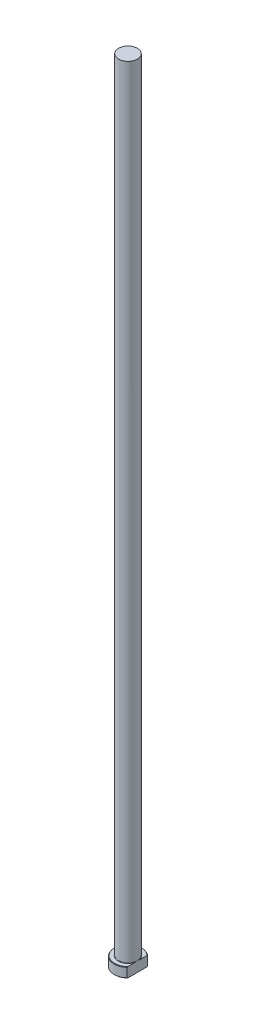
ISO-10303-21;
HEADER;
FILE_DESCRIPTION(('STEP AP214'),'2;1');
FILE_NAME('part.step','',(''),(''),'','','');
FILE_SCHEMA(('AUTOMOTIVE_DESIGN { 1 0 10303 214 1 1 1 1 }'));
ENDSEC;
DATA;
#1=APPLICATION_CONTEXT('core data for automotive mechanical design processes');
#2=APPLICATION_PROTOCOL_DEFINITION('international standard','automotive_design',2000,#1);
#3=PRODUCT_CONTEXT('',#1,'mechanical');
#4=PRODUCT('Part','Part','',(#3));
#5=PRODUCT_RELATED_PRODUCT_CATEGORY('part','',(#4));
#6=PRODUCT_DEFINITION_FORMATION('','',#4);
#7=PRODUCT_DEFINITION_CONTEXT('part definition',#1,'design');
#8=PRODUCT_DEFINITION('design','',#6,#7);
#9=PRODUCT_DEFINITION_SHAPE('','',#8);
#10=(LENGTH_UNIT() NAMED_UNIT(*) SI_UNIT(.MILLI.,.METRE.));
#11=(NAMED_UNIT(*) PLANE_ANGLE_UNIT() SI_UNIT($,.RADIAN.));
#12=(NAMED_UNIT(*) SI_UNIT($,.STERADIAN.) SOLID_ANGLE_UNIT());
#13=UNCERTAINTY_MEASURE_WITH_UNIT(LENGTH_MEASURE(1.E-05),#10,'distance_accuracy_value','');
#14=(GEOMETRIC_REPRESENTATION_CONTEXT(3) GLOBAL_UNCERTAINTY_ASSIGNED_CONTEXT((#13)) GLOBAL_UNIT_ASSIGNED_CONTEXT((#10,
#11,#12)) REPRESENTATION_CONTEXT('',''));
#15=CARTESIAN_POINT('',(0.,0.,0.));
#16=DIRECTION('',(0.,0.,1.));
#17=DIRECTION('',(1.,0.,0.));
#18=AXIS2_PLACEMENT_3D('',#15,#16,#17);
#19=CARTESIAN_POINT('',(0.,0.,0.));
#20=DIRECTION('',(0.,-1.,0.));
#21=DIRECTION('',(0.,0.,-1.));
#22=AXIS2_PLACEMENT_3D('',#19,#20,#21);
#23=PLANE('',#22);
#24=CARTESIAN_POINT('',(0.,0.,0.));
#25=DIRECTION('',(0.,-1.,0.));
#26=DIRECTION('',(0.,0.,-1.));
#27=AXIS2_PLACEMENT_3D('',#24,#25,#26);
#28=CIRCLE('',#27,6.79999999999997);
#29=CARTESIAN_POINT('',(4.74999999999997,0.,4.86595314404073));
#30=VERTEX_POINT('',#29);
#31=CARTESIAN_POINT('',(4.74999999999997,0.,-4.86595314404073));
#32=VERTEX_POINT('',#31);
#33=EDGE_CURVE('E98',#30,#32,#28,.T.);
#34=ORIENTED_EDGE('',*,*,#33,.T.);
#35=DIRECTION('',(0.,0.,1.));
#36=VECTOR('',#35,1.);
#37=CARTESIAN_POINT('',(4.74999999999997,0.,-5.14174095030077));
#38=LINE('',#37,#36);
#39=EDGE_CURVE('E83',#32,#30,#38,.T.);
#40=ORIENTED_EDGE('',*,*,#39,.T.);
#41=EDGE_LOOP('',(#34,#40));
#42=FACE_BOUND('',#41,.T.);
#43=ADVANCED_FACE('F32',(#42),#23,.T.);
#44=CARTESIAN_POINT('',(0.,259.958771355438,0.));
#45=DIRECTION('',(0.,1.,0.));
#46=DIRECTION('',(0.,0.,1.));
#47=AXIS2_PLACEMENT_3D('',#44,#45,#46);
#48=CYLINDRICAL_SURFACE('',#47,6.99999999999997);
#49=CARTESIAN_POINT('',(0.,4.80000000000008,0.));
#50=DIRECTION('',(0.,1.,0.));
#51=DIRECTION('',(0.,0.,1.));
#52=AXIS2_PLACEMENT_3D('',#49,#50,#51);
#53=CIRCLE('',#52,6.99999999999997);
#54=CARTESIAN_POINT('',(4.74999999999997,4.80000000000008,5.14174095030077));
#55=VERTEX_POINT('',#54);
#56=CARTESIAN_POINT('',(4.74999999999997,4.80000000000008,-5.14174095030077));
#57=VERTEX_POINT('',#56);
#58=EDGE_CURVE('E104',#55,#57,#53,.F.);
#59=ORIENTED_EDGE('',*,*,#58,.T.);
#60=DIRECTION('',(0.,-1.,0.));
#61=VECTOR('',#60,1.);
#62=CARTESIAN_POINT('',(4.74999999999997,400.,-5.14174095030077));
#63=LINE('',#62,#61);
#64=CARTESIAN_POINT('',(4.74999999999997,0.199999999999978,-5.14174095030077));
#65=VERTEX_POINT('',#64);
#66=EDGE_CURVE('E183',#57,#65,#63,.T.);
#67=ORIENTED_EDGE('',*,*,#66,.T.);
#68=CARTESIAN_POINT('',(0.,0.199999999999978,0.));
#69=DIRECTION('',(0.,-1.,0.));
#70=DIRECTION('',(0.,0.,-1.));
#71=AXIS2_PLACEMENT_3D('',#68,#69,#70);
#72=CIRCLE('',#71,6.99999999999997);
#73=CARTESIAN_POINT('',(4.74999999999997,0.199999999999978,5.14174095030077));
#74=VERTEX_POINT('',#73);
#75=EDGE_CURVE('E100',#65,#74,#72,.F.);
#76=ORIENTED_EDGE('',*,*,#75,.T.);
#77=DIRECTION('',(0.,-1.,0.));
#78=VECTOR('',#77,1.);
#79=CARTESIAN_POINT('',(4.74999999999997,400.,5.14174095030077));
#80=LINE('',#79,#78);
#81=EDGE_CURVE('E93',#55,#74,#80,.T.);
#82=ORIENTED_EDGE('',*,*,#81,.F.);
#83=EDGE_LOOP('',(#59,#67,#76,#82));
#84=FACE_BOUND('',#83,.T.);
#85=ADVANCED_FACE('F158',(#84),#48,.T.);
#86=CARTESIAN_POINT('',(-6.99999999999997,5.,0.));
#87=DIRECTION('',(0.,1.,0.));
#88=DIRECTION('',(0.,0.,1.));
#89=AXIS2_PLACEMENT_3D('',#86,#87,#88);
#90=PLANE('',#89);
#91=CARTESIAN_POINT('',(0.,5.,0.));
#92=DIRECTION('',(0.,1.,0.));
#93=DIRECTION('',(0.,0.,1.));
#94=AXIS2_PLACEMENT_3D('',#91,#92,#93);
#95=CIRCLE('',#94,6.80000000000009);
#96=CARTESIAN_POINT('',(4.74999999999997,5.,-4.8659531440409));
#97=VERTEX_POINT('',#96);
#98=CARTESIAN_POINT('',(4.74999999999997,5.,4.8659531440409));
#99=VERTEX_POINT('',#98);
#100=EDGE_CURVE('E178',#97,#99,#95,.T.);
#101=ORIENTED_EDGE('',*,*,#100,.T.);
#102=DIRECTION('',(0.,0.,-1.));
#103=VECTOR('',#102,1.);
#104=CARTESIAN_POINT('',(4.74999999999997,5.,0.));
#105=LINE('',#104,#103);
#106=CARTESIAN_POINT('',(4.74999999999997,4.99999999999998,1.3928388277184));
#107=VERTEX_POINT('',#106);
#108=EDGE_CURVE('E57',#99,#107,#105,.T.);
#109=ORIENTED_EDGE('',*,*,#108,.T.);
#110=CARTESIAN_POINT('',(0.,5.,0.));
#111=DIRECTION('',(0.,1.,0.));
#112=DIRECTION('',(0.,0.,1.));
#113=AXIS2_PLACEMENT_3D('',#110,#111,#112);
#114=CIRCLE('',#113,4.94999999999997);
#115=CARTESIAN_POINT('',(4.74999999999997,4.99999999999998,-1.3928388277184));
#116=VERTEX_POINT('',#115);
#117=EDGE_CURVE('E107',#107,#116,#114,.F.);
#118=ORIENTED_EDGE('',*,*,#117,.T.);
#119=EDGE_CURVE('E136',#116,#97,#105,.T.);
#120=ORIENTED_EDGE('',*,*,#119,.T.);
#121=EDGE_LOOP('',(#101,#109,#118,#120));
#122=FACE_BOUND('',#121,.T.);
#123=ADVANCED_FACE('F147',(#122),#90,.T.);
#124=CARTESIAN_POINT('',(0.,5.,0.));
#125=DIRECTION('',(0.,-1.,0.));
#126=DIRECTION('',(0.,0.,-1.));
#127=AXIS2_PLACEMENT_3D('',#124,#125,#126);
#128=CONICAL_SURFACE('',#127,6.80000000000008,0.785398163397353);
#129=ORIENTED_EDGE('',*,*,#58,.F.);
#130=CARTESIAN_POINT('',(4.74999999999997,-0.4699194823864,11.3131969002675));
#131=CARTESIAN_POINT('',(4.74999999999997,-0.314696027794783,11.1448436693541));
#132=CARTESIAN_POINT('',(4.74999999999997,-0.159749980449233,10.9762347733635));
#133=CARTESIAN_POINT('',(4.74999999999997,0.149503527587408,10.6384300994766));
#134=CARTESIAN_POINT('',(4.74999999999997,0.303810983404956,10.4692343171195));
#135=CARTESIAN_POINT('',(4.74999999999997,0.765713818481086,9.96058276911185));
#136=CARTESIAN_POINT('',(4.74999999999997,1.07222147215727,9.62013661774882));
#137=CARTESIAN_POINT('',(4.74999999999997,1.68320129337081,8.93374171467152));
#138=CARTESIAN_POINT('',(4.74999999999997,1.98765016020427,8.58777219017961));
#139=CARTESIAN_POINT('',(4.74999999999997,2.59113928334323,7.89119777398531));
#140=CARTESIAN_POINT('',(4.74999999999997,2.8901801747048,7.54059343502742));
#141=CARTESIAN_POINT('',(4.74999999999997,3.42455557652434,6.90003552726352));
#142=CARTESIAN_POINT('',(4.74999999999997,3.66121599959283,6.61119029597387));
#143=CARTESIAN_POINT('',(4.74999999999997,4.12759376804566,6.02778658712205));
#144=CARTESIAN_POINT('',(4.74999999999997,4.35730941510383,5.73322674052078));
#145=CARTESIAN_POINT('',(4.74999999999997,4.6941695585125,5.28581629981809));
#146=CARTESIAN_POINT('',(4.74999999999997,4.80511599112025,5.13582910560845));
#147=CARTESIAN_POINT('',(4.74999999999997,5.02390767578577,4.83361366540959));
#148=CARTESIAN_POINT('',(4.74999999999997,5.1317530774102,4.68138552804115));
#149=CARTESIAN_POINT('',(4.74999999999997,5.34359776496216,4.37435384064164));
#150=CARTESIAN_POINT('',(4.74999999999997,5.44759851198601,4.21955130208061));
#151=CARTESIAN_POINT('',(4.74999999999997,5.65085213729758,3.90687079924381));
#152=CARTESIAN_POINT('',(4.74999999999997,5.75010555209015,3.7489931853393));
#153=CARTESIAN_POINT('',(4.74999999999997,5.94167933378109,3.43122886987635));
#154=CARTESIAN_POINT('',(4.74999999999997,6.0340594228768,3.27137837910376));
#155=CARTESIAN_POINT('',(4.74999999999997,6.21141459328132,2.94756528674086));
#156=CARTESIAN_POINT('',(4.74999999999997,6.29638886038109,2.78360223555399));
#157=CARTESIAN_POINT('',(4.74999999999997,6.45680192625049,2.45121104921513));
#158=CARTESIAN_POINT('',(4.74999999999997,6.53224904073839,2.28278696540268));
#159=CARTESIAN_POINT('',(4.74999999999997,6.6710923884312,1.94101575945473));
#160=CARTESIAN_POINT('',(4.74999999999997,6.7344921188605,1.76767008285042));
#161=CARTESIAN_POINT('',(4.74999999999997,6.83411180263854,1.45416369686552));
#162=CARTESIAN_POINT('',(4.74999999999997,6.87324454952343,1.31493382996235));
#163=CARTESIAN_POINT('',(4.74999999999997,6.94070239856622,1.03386040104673));
#164=CARTESIAN_POINT('',(4.74999999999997,6.96902891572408,0.892017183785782));
#165=CARTESIAN_POINT('',(4.74999999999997,7.01345691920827,0.606842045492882));
#166=CARTESIAN_POINT('',(4.74999999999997,7.02959521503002,0.46351594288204));
#167=CARTESIAN_POINT('',(4.74999999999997,7.04890487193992,0.17598432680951));
#168=CARTESIAN_POINT('',(4.74999999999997,7.0520767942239,0.0317788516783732));
#169=CARTESIAN_POINT('',(4.74999999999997,7.04526462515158,-0.256545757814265));
#170=CARTESIAN_POINT('',(4.74999999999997,7.03525957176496,-0.400664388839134));
#171=CARTESIAN_POINT('',(4.74999999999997,7.00262759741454,-0.687454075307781));
#172=CARTESIAN_POINT('',(4.74999999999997,6.97999962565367,-0.830125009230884));
#173=CARTESIAN_POINT('',(4.74999999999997,6.92319898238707,-1.11357185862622));
#174=CARTESIAN_POINT('',(4.74999999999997,6.88899117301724,-1.25434063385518));
#175=CARTESIAN_POINT('',(4.74999999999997,6.81053576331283,-1.53301777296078));
#176=CARTESIAN_POINT('',(4.74999999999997,6.76628793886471,-1.6709260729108));
#177=CARTESIAN_POINT('',(4.74999999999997,6.66151350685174,-1.96556191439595));
#178=CARTESIAN_POINT('',(4.74999999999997,6.59951436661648,-2.12176199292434));
#179=CARTESIAN_POINT('',(4.74999999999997,6.46624368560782,-2.43018851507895));
#180=CARTESIAN_POINT('',(4.74999999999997,6.3949679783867,-2.58241313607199));
#181=CARTESIAN_POINT('',(4.74999999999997,6.24487152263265,-2.88340045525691));
#182=CARTESIAN_POINT('',(4.74999999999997,6.16603778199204,-3.03215662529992));
#183=CARTESIAN_POINT('',(4.74999999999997,6.0024213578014,-3.32631225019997));
#184=CARTESIAN_POINT('',(4.74999999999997,5.91763949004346,-3.47171216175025));
#185=CARTESIAN_POINT('',(4.74999999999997,5.7422196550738,-3.76133460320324));
#186=CARTESIAN_POINT('',(4.74999999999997,5.65152319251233,-3.90552153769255));
#187=CARTESIAN_POINT('',(4.74999999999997,5.46614513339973,-4.1913052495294));
#188=CARTESIAN_POINT('',(4.74999999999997,5.37146343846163,-4.33290196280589));
#189=CARTESIAN_POINT('',(4.74999999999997,5.1789439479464,-4.61371009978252));
#190=CARTESIAN_POINT('',(4.74999999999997,5.0811095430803,-4.75292385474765));
#191=CARTESIAN_POINT('',(4.74999999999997,4.88274984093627,-5.02942406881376));
#192=CARTESIAN_POINT('',(4.74999999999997,4.78222443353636,-5.1667104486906));
#193=CARTESIAN_POINT('',(4.74999999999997,4.47850577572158,-5.57446661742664));
#194=CARTESIAN_POINT('',(4.74999999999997,4.27202152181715,-5.84248508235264));
#195=CARTESIAN_POINT('',(4.74999999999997,3.85277361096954,-6.37356852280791));
#196=CARTESIAN_POINT('',(4.74999999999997,3.64000936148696,-6.63663302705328));
#197=CARTESIAN_POINT('',(4.74999999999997,3.20967704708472,-7.15912738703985));
#198=CARTESIAN_POINT('',(4.74999999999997,2.99210547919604,-7.41855435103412));
#199=CARTESIAN_POINT('',(4.74999999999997,2.55343543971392,-7.93440929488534));
#200=CARTESIAN_POINT('',(4.74999999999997,2.33233690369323,-8.19083721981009));
#201=CARTESIAN_POINT('',(4.74999999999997,1.8985117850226,-8.68856037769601));
#202=CARTESIAN_POINT('',(4.74999999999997,1.68591840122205,-8.92997190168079));
#203=CARTESIAN_POINT('',(4.74999999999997,1.25875024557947,-9.41103988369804));
#204=CARTESIAN_POINT('',(4.74999999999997,1.04417544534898,-9.65069631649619));
#205=CARTESIAN_POINT('',(4.74999999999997,0.613761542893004,-10.1281845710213));
#206=CARTESIAN_POINT('',(4.74999999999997,0.39792496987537,-10.3660186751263));
#207=CARTESIAN_POINT('',(4.74999999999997,-0.035070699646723,-10.8404648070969));
#208=CARTESIAN_POINT('',(4.74999999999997,-0.252229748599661,-11.0770768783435));
#209=CARTESIAN_POINT('',(4.74999999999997,-0.4699194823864,-11.3131969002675));
#210=B_SPLINE_CURVE_WITH_KNOTS('',3,(#130,#131,#132,#133,#134,#135,#136,#137,#138,#139,#140,
#141,#142,#143,#144,#145,#146,#147,#148,#149,#150,#151,#152,#153,#154,#155,#156,#157,#158,#159,
#160,#161,#162,#163,#164,#165,#166,#167,#168,#169,#170,#171,#172,#173,#174,#175,#176,#177,#178,
#179,#180,#181,#182,#183,#184,#185,#186,#187,#188,#189,#190,#191,#192,#193,#194,#195,#196,#197,
#198,#199,#200,#201,#202,#203,#204,#205,#206,#207,#208,#209),.UNSPECIFIED.,.F.,.F.,(4,2,2,2,2,2,
2,2,2,2,2,2,2,2,2,2,2,2,2,2,2,2,2,2,2,2,2,2,2,2,2,2,2,2,2,2,2,2,2,4),(0.,0.686973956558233,
1.37395314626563,2.74821299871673,4.13073127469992,5.51308613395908,6.63326732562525,
7.75372027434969,8.31337506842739,8.87300282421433,9.43241566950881,9.99176514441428,
10.5454852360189,11.0992661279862,11.6525602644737,12.2056935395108,12.6392019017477,
13.0726534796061,13.5047907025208,13.9369092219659,14.3697159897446,14.8025587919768,
15.2367269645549,15.6709048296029,16.1746896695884,16.6787015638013,17.1835959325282,
17.6884211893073,18.1993613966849,18.7103142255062,19.2207347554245,19.7311762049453,
20.7460271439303,21.7609741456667,22.7766868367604,23.7924181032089,24.7574331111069,
25.7224619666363,26.6859680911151,27.6494397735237),.UNSPECIFIED.);
#211=EDGE_CURVE('E135',#55,#99,#210,.T.);
#212=ORIENTED_EDGE('',*,*,#211,.T.);
#213=ORIENTED_EDGE('',*,*,#100,.F.);
#214=EDGE_CURVE('E127',#97,#57,#210,.T.);
#215=ORIENTED_EDGE('',*,*,#214,.T.);
#216=EDGE_LOOP('',(#129,#212,#213,#215));
#217=FACE_BOUND('',#216,.T.);
#218=ADVANCED_FACE('F143',(#217),#128,.T.);
#219=CARTESIAN_POINT('',(0.,0.199999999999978,0.));
#220=DIRECTION('',(0.,1.,0.));
#221=DIRECTION('',(0.,0.,1.));
#222=AXIS2_PLACEMENT_3D('',#219,#220,#221);
#223=CONICAL_SURFACE('',#222,6.99999999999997,0.785398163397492);
#224=ORIENTED_EDGE('',*,*,#75,.F.);
#225=CARTESIAN_POINT('',(4.74999999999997,5.469919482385,-11.3131969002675));
#226=CARTESIAN_POINT('',(4.74999999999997,5.3146960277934,-11.1448436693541));
#227=CARTESIAN_POINT('',(4.74999999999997,5.15974998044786,-10.9762347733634));
#228=CARTESIAN_POINT('',(4.74999999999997,4.85049647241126,-10.6384300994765));
#229=CARTESIAN_POINT('',(4.74999999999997,4.69618901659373,-10.4692343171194));
#230=CARTESIAN_POINT('',(4.74999999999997,4.23428618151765,-9.96058276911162));
#231=CARTESIAN_POINT('',(4.74999999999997,3.9277785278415,-9.62013661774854));
#232=CARTESIAN_POINT('',(4.74999999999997,3.31679870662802,-8.93374171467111));
#233=CARTESIAN_POINT('',(4.74999999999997,3.01234983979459,-8.58777219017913));
#234=CARTESIAN_POINT('',(4.74999999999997,2.4088607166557,-7.8911977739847));
#235=CARTESIAN_POINT('',(4.74999999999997,2.10981982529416,-7.54059343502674));
#236=CARTESIAN_POINT('',(4.74999999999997,1.57544442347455,-6.90003552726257));
#237=CARTESIAN_POINT('',(4.74999999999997,1.33878400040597,-6.6111902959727));
#238=CARTESIAN_POINT('',(4.74999999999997,0.872406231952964,-6.02778658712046));
#239=CARTESIAN_POINT('',(4.74999999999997,0.642690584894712,-5.73322674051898));
#240=CARTESIAN_POINT('',(4.74999999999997,0.305830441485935,-5.28581629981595));
#241=CARTESIAN_POINT('',(4.74999999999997,0.194884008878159,-5.13582910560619));
#242=CARTESIAN_POINT('',(4.74999999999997,-0.0239076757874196,-4.83361366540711));
#243=CARTESIAN_POINT('',(4.74999999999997,-0.131753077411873,-4.68138552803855));
#244=CARTESIAN_POINT('',(4.74999999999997,-0.343597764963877,-4.3743538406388));
#245=CARTESIAN_POINT('',(4.74999999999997,-0.447598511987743,-4.21955130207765));
#246=CARTESIAN_POINT('',(4.74999999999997,-0.650852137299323,-3.9068707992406));
#247=CARTESIAN_POINT('',(4.74999999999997,-0.750105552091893,-3.74899318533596));
#248=CARTESIAN_POINT('',(4.74999999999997,-0.941679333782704,-3.43122886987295));
#249=CARTESIAN_POINT('',(4.74999999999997,-1.03405942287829,-3.27137837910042));
#250=CARTESIAN_POINT('',(4.74999999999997,-1.21141459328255,-2.94756528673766));
#251=CARTESIAN_POINT('',(4.74999999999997,-1.29638886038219,-2.78360223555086));
#252=CARTESIAN_POINT('',(4.74999999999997,-1.45680192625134,-2.45121104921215));
#253=CARTESIAN_POINT('',(4.74999999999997,-1.53224904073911,-2.28278696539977));
#254=CARTESIAN_POINT('',(4.74999999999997,-1.67109238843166,-1.94101575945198));
#255=CARTESIAN_POINT('',(4.74999999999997,-1.73449211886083,-1.76767008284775));
#256=CARTESIAN_POINT('',(4.74999999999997,-1.83411180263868,-1.45416369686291));
#257=CARTESIAN_POINT('',(4.74999999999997,-1.87324454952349,-1.31493382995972));
#258=CARTESIAN_POINT('',(4.74999999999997,-1.94070239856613,-1.03386040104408));
#259=CARTESIAN_POINT('',(4.74999999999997,-1.96902891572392,-0.892017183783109));
#260=CARTESIAN_POINT('',(4.74999999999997,-2.01345691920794,-0.606842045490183));
#261=CARTESIAN_POINT('',(4.74999999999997,-2.0295952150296,-0.463515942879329));
#262=CARTESIAN_POINT('',(4.74999999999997,-2.04890487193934,-0.175984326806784));
#263=CARTESIAN_POINT('',(4.74999999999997,-2.05207679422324,-0.0317788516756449));
#264=CARTESIAN_POINT('',(4.74999999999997,-2.04526462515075,0.256545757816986));
#265=CARTESIAN_POINT('',(4.74999999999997,-2.03525957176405,0.400664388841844));
#266=CARTESIAN_POINT('',(4.74999999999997,-2.00262759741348,0.687454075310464));
#267=CARTESIAN_POINT('',(4.74999999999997,-1.97999962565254,0.83012500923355));
#268=CARTESIAN_POINT('',(4.74999999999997,-1.92319898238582,1.11357185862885));
#269=CARTESIAN_POINT('',(4.74999999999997,-1.88899117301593,1.25434063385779));
#270=CARTESIAN_POINT('',(4.74999999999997,-1.81053576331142,1.53301777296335));
#271=CARTESIAN_POINT('',(4.74999999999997,-1.76628793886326,1.67092607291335));
#272=CARTESIAN_POINT('',(4.74999999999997,-1.6615135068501,1.96556191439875));
#273=CARTESIAN_POINT('',(4.74999999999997,-1.59951436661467,2.12176199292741));
#274=CARTESIAN_POINT('',(4.74999999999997,-1.46624368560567,2.43018851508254));
#275=CARTESIAN_POINT('',(4.74999999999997,-1.39496797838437,2.58241313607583));
#276=CARTESIAN_POINT('',(4.74999999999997,-1.24487152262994,2.88340045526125));
#277=CARTESIAN_POINT('',(4.74999999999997,-1.16603778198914,3.0321566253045));
#278=CARTESIAN_POINT('',(4.74999999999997,-1.00242135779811,3.32631225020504));
#279=CARTESIAN_POINT('',(4.74999999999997,-0.917639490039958,3.47171216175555));
#280=CARTESIAN_POINT('',(4.74999999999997,-0.742219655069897,3.76133460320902));
#281=CARTESIAN_POINT('',(4.74999999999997,-0.651523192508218,3.90552153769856));
#282=CARTESIAN_POINT('',(4.74999999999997,-0.466145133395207,4.19130524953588));
#283=CARTESIAN_POINT('',(4.74999999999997,-0.371463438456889,4.3329019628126));
#284=CARTESIAN_POINT('',(4.74999999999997,-0.178943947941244,4.61371009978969));
#285=CARTESIAN_POINT('',(4.74999999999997,-0.0811095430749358,4.75292385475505));
#286=CARTESIAN_POINT('',(4.74999999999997,0.117250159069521,5.02942406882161));
#287=CARTESIAN_POINT('',(4.74999999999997,0.217775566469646,5.16671044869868));
#288=CARTESIAN_POINT('',(4.74999999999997,0.521494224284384,5.57446661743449));
#289=CARTESIAN_POINT('',(4.74999999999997,0.727978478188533,5.84248508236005));
#290=CARTESIAN_POINT('',(4.74999999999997,1.14722638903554,6.37356852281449));
#291=CARTESIAN_POINT('',(4.74999999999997,1.35999063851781,6.63663302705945));
#292=CARTESIAN_POINT('',(4.74999999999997,1.79032295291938,7.15912738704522));
#293=CARTESIAN_POINT('',(4.74999999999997,2.00789452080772,7.41855435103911));
#294=CARTESIAN_POINT('',(4.74999999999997,2.44656456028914,7.93440929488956));
#295=CARTESIAN_POINT('',(4.74999999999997,2.66766309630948,8.19083721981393));
#296=CARTESIAN_POINT('',(4.74999999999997,3.10148821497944,8.68856037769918));
#297=CARTESIAN_POINT('',(4.74999999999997,3.31408159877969,8.92997190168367));
#298=CARTESIAN_POINT('',(4.74999999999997,3.74124975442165,9.41103988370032));
#299=CARTESIAN_POINT('',(4.74999999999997,3.95582455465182,9.65069631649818));
#300=CARTESIAN_POINT('',(4.74999999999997,4.38623845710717,10.1281845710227));
#301=CARTESIAN_POINT('',(4.74999999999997,4.60207503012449,10.3660186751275));
#302=CARTESIAN_POINT('',(4.74999999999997,5.03507069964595,10.8404648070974));
#303=CARTESIAN_POINT('',(4.74999999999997,5.25222974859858,11.0770768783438));
#304=CARTESIAN_POINT('',(4.74999999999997,5.469919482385,11.3131969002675));
#305=B_SPLINE_CURVE_WITH_KNOTS('',3,(#225,#226,#227,#228,#229,#230,#231,#232,#233,#234,#235,
#236,#237,#238,#239,#240,#241,#242,#243,#244,#245,#246,#247,#248,#249,#250,#251,#252,#253,#254,
#255,#256,#257,#258,#259,#260,#261,#262,#263,#264,#265,#266,#267,#268,#269,#270,#271,#272,#273,
#274,#275,#276,#277,#278,#279,#280,#281,#282,#283,#284,#285,#286,#287,#288,#289,#290,#291,#292,
#293,#294,#295,#296,#297,#298,#299,#300,#301,#302,#303,#304),.UNSPECIFIED.,.F.,.F.,(4,2,2,2,2,2,
2,2,2,2,2,2,2,2,2,2,2,2,2,2,2,2,2,2,2,2,2,2,2,2,2,2,2,2,2,2,2,2,2,4),(0.,0.686973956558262,
1.37395314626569,2.74821299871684,4.13073127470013,5.51308613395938,6.63326732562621,
7.75372027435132,8.31337506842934,8.87300282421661,9.43241566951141,9.99176514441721,
10.5454852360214,11.0992661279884,11.6525602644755,12.2056935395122,12.6392019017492,
13.0726534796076,13.5047907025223,13.9369092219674,14.3697159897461,14.8025587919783,
15.2367269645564,15.6709048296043,16.1746896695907,16.6787015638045,17.1835959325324,
17.6884211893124,18.1993613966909,18.7103142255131,19.2207347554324,19.7311762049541,
20.7460271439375,21.7609741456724,22.7766868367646,23.7924181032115,24.7574331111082,
25.7224619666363,26.6859680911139,27.6494397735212),.UNSPECIFIED.);
#306=EDGE_CURVE('E86',#65,#32,#305,.T.);
#307=ORIENTED_EDGE('',*,*,#306,.T.);
#308=ORIENTED_EDGE('',*,*,#33,.F.);
#309=EDGE_CURVE('E89',#30,#74,#305,.T.);
#310=ORIENTED_EDGE('',*,*,#309,.T.);
#311=EDGE_LOOP('',(#224,#307,#308,#310));
#312=FACE_BOUND('',#311,.T.);
#313=ADVANCED_FACE('F97',(#312),#223,.T.);
#314=CARTESIAN_POINT('',(0.,5.19999999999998,0.));
#315=DIRECTION('',(0.,1.,0.));
#316=DIRECTION('',(0.,0.,1.));
#317=AXIS2_PLACEMENT_3D('',#314,#315,#316);
#318=TOROIDAL_SURFACE('',#317,4.94999999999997,0.2);
#319=CARTESIAN_POINT('',(4.74999999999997,5.19999999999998,0.));
#320=CARTESIAN_POINT('',(4.74999999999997,5.20000051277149,9.99652561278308E-11));
#321=CARTESIAN_POINT('',(4.74999999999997,5.20000102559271,-2.61635066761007E-07));
#322=CARTESIAN_POINT('',(4.74999999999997,5.20000197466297,-9.45069474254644E-07));
#323=CARTESIAN_POINT('',(4.74999999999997,5.20000238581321,-1.38557317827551E-06));
#324=CARTESIAN_POINT('',(4.74999999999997,5.20000327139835,-2.4536130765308E-06));
#325=CARTESIAN_POINT('',(4.74999999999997,5.20000372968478,-3.09837225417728E-06));
#326=CARTESIAN_POINT('',(4.74999999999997,5.20000452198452,-4.40742113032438E-06));
#327=CARTESIAN_POINT('',(4.74999999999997,5.20000486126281,-5.0689040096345E-06));
#328=CARTESIAN_POINT('',(4.74999999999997,5.20000618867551,-7.7310439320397E-06));
#329=CARTESIAN_POINT('',(4.74999999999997,5.20000711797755,-9.76516679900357E-06));
#330=CARTESIAN_POINT('',(4.74999999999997,5.20000857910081,-1.37140842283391E-05));
#331=CARTESIAN_POINT('',(4.74999999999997,5.20000914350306,-1.56172163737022E-05));
#332=CARTESIAN_POINT('',(4.74999999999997,5.20001162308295,-2.39378885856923E-05));
#333=CARTESIAN_POINT('',(4.74999999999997,5.20001356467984,-3.03487881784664E-05));
#334=CARTESIAN_POINT('',(4.74999999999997,5.2000163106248,-4.22704269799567E-05));
#335=CARTESIAN_POINT('',(4.74999999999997,5.20001725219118,-4.77489234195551E-05));
#336=CARTESIAN_POINT('',(4.74999999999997,5.20002427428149,-8.92044157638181E-05));
#337=CARTESIAN_POINT('',(4.74999999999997,5.20002979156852,-0.000125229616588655));
#338=CARTESIAN_POINT('',(4.74999999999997,5.20005392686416,-0.000268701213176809));
#339=CARTESIAN_POINT('',(4.74999999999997,5.2000767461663,-0.000375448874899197));
#340=CARTESIAN_POINT('',(4.74999999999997,5.20016644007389,-0.000801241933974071));
#341=CARTESIAN_POINT('',(4.74999999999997,5.20023075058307,-0.00112063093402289));
#342=CARTESIAN_POINT('',(4.74999999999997,5.20048998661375,-0.00239962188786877));
#343=CARTESIAN_POINT('',(4.74999999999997,5.20068823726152,-0.00335875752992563));
#344=CARTESIAN_POINT('',(4.74999999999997,5.20151726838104,-0.00737911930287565));
#345=CARTESIAN_POINT('',(4.74999999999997,5.20214386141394,-0.0104409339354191));
#346=CARTESIAN_POINT('',(4.74999999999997,5.21008545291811,-0.0492358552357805));
#347=CARTESIAN_POINT('',(4.74999999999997,5.21742440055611,-0.0849658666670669));
#348=CARTESIAN_POINT('',(4.74999999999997,5.23282863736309,-0.160441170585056));
#349=CARTESIAN_POINT('',(4.74999999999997,5.24088334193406,-0.20018852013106));
#350=CARTESIAN_POINT('',(4.74999999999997,5.25445255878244,-0.267938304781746));
#351=CARTESIAN_POINT('',(4.74999999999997,5.26001263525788,-0.29593149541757));
#352=CARTESIAN_POINT('',(4.74999999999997,5.27085683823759,-0.351182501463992));
#353=CARTESIAN_POINT('',(4.74999999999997,5.27614435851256,-0.378439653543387));
#354=CARTESIAN_POINT('',(4.74999999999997,5.29324107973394,-0.467894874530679));
#355=CARTESIAN_POINT('',(4.74999999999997,5.30473398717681,-0.530154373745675));
#356=CARTESIAN_POINT('',(4.74999999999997,5.32662739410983,-0.655478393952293));
#357=CARTESIAN_POINT('',(4.74999999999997,5.3370164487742,-0.718544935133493));
#358=CARTESIAN_POINT('',(4.74999999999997,5.35699717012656,-0.851017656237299));
#359=CARTESIAN_POINT('',(4.74999999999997,5.36641623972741,-0.920450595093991));
#360=CARTESIAN_POINT('',(4.74999999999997,5.38234392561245,-1.05946734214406));
#361=CARTESIAN_POINT('',(4.74999999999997,5.38886038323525,-1.12905022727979));
#362=CARTESIAN_POINT('',(4.74999999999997,5.39773147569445,-1.26617933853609));
#363=CARTESIAN_POINT('',(4.74999999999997,5.40021821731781,-1.33371570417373));
#364=CARTESIAN_POINT('',(4.74999999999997,5.39987187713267,-1.43440379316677));
#365=CARTESIAN_POINT('',(4.74999999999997,5.39910217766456,-1.46756163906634));
#366=CARTESIAN_POINT('',(4.74999999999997,5.3959313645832,-1.53379187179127));
#367=CARTESIAN_POINT('',(4.74999999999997,5.3935310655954,-1.56686429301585));
#368=CARTESIAN_POINT('',(4.74999999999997,5.38754200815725,-1.62421123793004));
#369=CARTESIAN_POINT('',(4.74999999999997,5.38442539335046,-1.64853446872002));
#370=CARTESIAN_POINT('',(4.74999999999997,5.37675802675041,-1.69705811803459));
#371=CARTESIAN_POINT('',(4.74999999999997,5.37220190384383,-1.721257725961));
#372=CARTESIAN_POINT('',(4.74999999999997,5.36082299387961,-1.77105703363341));
#373=CARTESIAN_POINT('',(4.74999999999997,5.353854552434,-1.79662379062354));
#374=CARTESIAN_POINT('',(4.74999999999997,5.33689507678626,-1.84682085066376));
#375=CARTESIAN_POINT('',(4.74999999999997,5.32690690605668,-1.87145201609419));
#376=CARTESIAN_POINT('',(4.74999999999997,5.30823837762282,-1.90659698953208));
#377=CARTESIAN_POINT('',(4.74999999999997,5.30136403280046,-1.91805641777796));
#378=CARTESIAN_POINT('',(4.74999999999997,5.28594833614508,-1.93977517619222));
#379=CARTESIAN_POINT('',(4.74999999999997,5.27741816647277,-1.95004185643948));
#380=CARTESIAN_POINT('',(4.74999999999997,5.26375777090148,-1.9629385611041));
#381=CARTESIAN_POINT('',(4.74999999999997,5.25954376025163,-1.96653183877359));
#382=CARTESIAN_POINT('',(4.74999999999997,5.25068624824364,-1.97316149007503));
#383=CARTESIAN_POINT('',(4.74999999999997,5.24604250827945,-1.97619755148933));
#384=CARTESIAN_POINT('',(4.74999999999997,5.23626853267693,-1.98154515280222));
#385=CARTESIAN_POINT('',(4.74999999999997,5.23113290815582,-1.98384708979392));
#386=CARTESIAN_POINT('',(4.74999999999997,5.22051769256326,-1.98742814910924));
#387=CARTESIAN_POINT('',(4.74999999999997,5.21503893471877,-1.98870965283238));
#388=CARTESIAN_POINT('',(4.74999999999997,5.20449183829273,-1.99000622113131));
#389=CARTESIAN_POINT('',(4.74999999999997,5.19943775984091,-1.99013586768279));
#390=CARTESIAN_POINT('',(4.74999999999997,5.18940003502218,-1.98941072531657));
#391=CARTESIAN_POINT('',(4.74999999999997,5.18441641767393,-1.98855554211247));
#392=CARTESIAN_POINT('',(4.74999999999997,5.17528807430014,-1.98612622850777));
#393=CARTESIAN_POINT('',(4.74999999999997,5.17111543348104,-1.98465315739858));
#394=CARTESIAN_POINT('',(4.74999999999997,5.16301803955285,-1.98114415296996));
#395=CARTESIAN_POINT('',(4.74999999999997,5.15909332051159,-1.9791081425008));
#396=CARTESIAN_POINT('',(4.74999999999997,5.14879352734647,-1.97296283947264));
#397=CARTESIAN_POINT('',(4.74999999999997,5.14268143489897,-1.96841428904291));
#398=CARTESIAN_POINT('',(4.74999999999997,5.1312135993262,-1.95844367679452));
#399=CARTESIAN_POINT('',(4.74999999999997,5.12586068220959,-1.95301850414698));
#400=CARTESIAN_POINT('',(4.74999999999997,5.11142906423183,-1.93662763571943));
#401=CARTESIAN_POINT('',(4.74999999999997,5.10316616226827,-1.92495191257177));
#402=CARTESIAN_POINT('',(4.74999999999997,5.08829914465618,-1.90062693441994));
#403=CARTESIAN_POINT('',(4.74999999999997,5.08169771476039,-1.88797614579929));
#404=CARTESIAN_POINT('',(4.74999999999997,5.06700138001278,-1.85623567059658));
#405=CARTESIAN_POINT('',(4.74999999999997,5.05959097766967,-1.83683236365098));
#406=CARTESIAN_POINT('',(4.74999999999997,5.04658538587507,-1.79741332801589));
#407=CARTESIAN_POINT('',(4.74999999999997,5.0409941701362,-1.77739636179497));
#408=CARTESIAN_POINT('',(4.74999999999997,5.0311351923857,-1.7367589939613));
#409=CARTESIAN_POINT('',(4.74999999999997,5.02688624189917,-1.71613409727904));
#410=CARTESIAN_POINT('',(4.74999999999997,5.01952414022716,-1.67471526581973));
#411=CARTESIAN_POINT('',(4.74999999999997,5.01640958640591,-1.65392157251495));
#412=CARTESIAN_POINT('',(4.74999999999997,5.00922057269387,-1.5974489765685));
#413=CARTESIAN_POINT('',(4.74999999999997,5.00602857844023,-1.56165812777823));
#414=CARTESIAN_POINT('',(4.74999999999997,5.00166820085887,-1.4899475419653));
#415=CARTESIAN_POINT('',(4.74999999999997,5.00050104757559,-1.45402773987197));
#416=CARTESIAN_POINT('',(4.74999999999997,4.99938051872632,-1.34597605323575));
#417=CARTESIAN_POINT('',(4.74999999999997,5.00183473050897,-1.27382091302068));
#418=CARTESIAN_POINT('',(4.74999999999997,5.01071422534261,-1.1348000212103));
#419=CARTESIAN_POINT('',(4.74999999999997,5.01685409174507,-1.06791253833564));
#420=CARTESIAN_POINT('',(4.74999999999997,5.03184377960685,-0.934412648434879));
#421=CARTESIAN_POINT('',(4.74999999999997,5.04069496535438,-0.86780039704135));
#422=CARTESIAN_POINT('',(4.74999999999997,5.05873681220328,-0.745814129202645));
#423=CARTESIAN_POINT('',(4.74999999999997,5.06763179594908,-0.690395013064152));
#424=CARTESIAN_POINT('',(4.74999999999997,5.08669539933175,-0.578250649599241));
#425=CARTESIAN_POINT('',(4.74999999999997,5.09689173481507,-0.521530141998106));
#426=CARTESIAN_POINT('',(4.74999999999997,5.11492144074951,-0.424926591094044));
#427=CARTESIAN_POINT('',(4.74999999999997,5.12256561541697,-0.385007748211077));
#428=CARTESIAN_POINT('',(4.74999999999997,5.13803971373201,-0.305676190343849));
#429=CARTESIAN_POINT('',(4.74999999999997,5.14586654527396,-0.266262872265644));
#430=CARTESIAN_POINT('',(4.74999999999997,5.16076951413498,-0.19204454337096));
#431=CARTESIAN_POINT('',(4.74999999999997,5.16782730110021,-0.157235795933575));
#432=CARTESIAN_POINT('',(4.74999999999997,5.18233886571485,-0.0861195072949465));
#433=CARTESIAN_POINT('',(4.74999999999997,5.18979650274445,-0.0498127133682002));
#434=CARTESIAN_POINT('',(4.74999999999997,5.19785759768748,-0.0104337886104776));
#435=CARTESIAN_POINT('',(4.74999999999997,5.19848564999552,-0.00736482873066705));
#436=CARTESIAN_POINT('',(4.74999999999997,5.19931501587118,-0.0033428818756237));
#437=CARTESIAN_POINT('',(4.74999999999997,5.19951211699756,-0.00238930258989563));
#438=CARTESIAN_POINT('',(4.74999999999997,5.19976995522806,-0.00111720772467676));
#439=CARTESIAN_POINT('',(4.74999999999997,5.19983399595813,-0.000799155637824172));
#440=CARTESIAN_POINT('',(4.74999999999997,5.19992336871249,-0.000374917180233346));
#441=CARTESIAN_POINT('',(4.74999999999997,5.19994614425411,-0.000268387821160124));
#442=CARTESIAN_POINT('',(4.74999999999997,5.19997023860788,-0.000125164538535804));
#443=CARTESIAN_POINT('',(4.74999999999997,5.19997575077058,-8.91681278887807E-05));
#444=CARTESIAN_POINT('',(4.74999999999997,5.19998276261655,-4.77422682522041E-05));
#445=CARTESIAN_POINT('',(4.74999999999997,5.19998370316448,-4.22652010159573E-05));
#446=CARTESIAN_POINT('',(4.74999999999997,5.19998644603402,-3.03466439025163E-05));
#447=CARTESIAN_POINT('',(4.74999999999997,5.19998838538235,-2.39373246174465E-05));
#448=CARTESIAN_POINT('',(4.74999999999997,5.19999086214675,-1.56183298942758E-05));
#449=CARTESIAN_POINT('',(4.74999999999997,5.19999142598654,-1.37153022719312E-05));
#450=CARTESIAN_POINT('',(4.74999999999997,5.19999288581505,-9.76651674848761E-06));
#451=CARTESIAN_POINT('',(4.74999999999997,5.19999381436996,-7.73240591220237E-06));
#452=CARTESIAN_POINT('',(4.74999999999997,5.1999951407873,-5.07019324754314E-06));
#453=CARTESIAN_POINT('',(4.74999999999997,5.19999547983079,-4.4086588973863E-06));
#454=CARTESIAN_POINT('',(4.74999999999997,5.19999627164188,-3.09946476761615E-06));
#455=CARTESIAN_POINT('',(4.74999999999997,5.19999672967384,-2.45460930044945E-06));
#456=CARTESIAN_POINT('',(4.74999999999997,5.19999761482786,-1.38635108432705E-06));
#457=CARTESIAN_POINT('',(4.74999999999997,5.19999802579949,-9.45734938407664E-07));
#458=CARTESIAN_POINT('',(4.74999999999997,5.19999897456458,-2.62005351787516E-07));
#459=CARTESIAN_POINT('',(4.74999999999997,5.19999948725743,-9.9959612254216E-11));
#460=CARTESIAN_POINT('',(4.74999999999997,5.19999999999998,0.));
#461=B_SPLINE_CURVE_WITH_KNOTS('',3,(#319,#320,#321,#322,#323,#324,#325,#326,#327,#328,#329,
#330,#331,#332,#333,#334,#335,#336,#337,#338,#339,#340,#341,#342,#343,#344,#345,#346,#347,#348,
#349,#350,#351,#352,#353,#354,#355,#356,#357,#358,#359,#360,#361,#362,#363,#364,#365,#366,#367,
#368,#369,#370,#371,#372,#373,#374,#375,#376,#377,#378,#379,#380,#381,#382,#383,#384,#385,#386,
#387,#388,#389,#390,#391,#392,#393,#394,#395,#396,#397,#398,#399,#400,#401,#402,#403,#404,#405,
#406,#407,#408,#409,#410,#411,#412,#413,#414,#415,#416,#417,#418,#419,#420,#421,#422,#423,#424,
#425,#426,#427,#428,#429,#430,#431,#432,#433,#434,#435,#436,#437,#438,#439,#440,#441,#442,#443,
#444,#445,#446,#447,#448,#449,#450,#451,#452,#453,#454,#455,#456,#457,#458,#459,#460),
.UNSPECIFIED.,.T.,.F.,(4,2,2,2,2,2,2,2,2,2,2,2,2,2,2,2,2,2,2,2,2,2,2,2,2,2,2,2,2,2,2,2,2,2,2,2,
2,2,2,2,2,2,2,2,2,2,2,2,2,2,2,2,2,2,2,2,2,2,2,2,2,2,2,2,2,2,2,2,2,2,4),(0.,1.57517755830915E-06,
3.40054002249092E-06,5.75445750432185E-06,7.98467699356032E-06,1.46735444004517E-05,
2.06230682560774E-05,4.06941666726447E-05,5.73532562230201E-05,0.000166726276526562,
0.000493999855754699,0.0014716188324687,0.00440957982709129,0.0137857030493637,
0.123211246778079,0.244877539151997,0.33049723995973,0.413792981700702,0.603718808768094,
0.795453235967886,1.00561491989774,1.21520536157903,1.41777458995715,1.51724627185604,
1.61666829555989,1.69020453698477,1.76401846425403,1.84342838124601,1.92276323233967,
1.96277163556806,2.00251870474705,2.01909887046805,2.03568829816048,2.05248658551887,
2.06924555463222,2.08431612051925,2.09939272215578,2.11261992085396,2.12584893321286,
2.14857242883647,2.1713784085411,2.21404845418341,2.25678703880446,2.31894678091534,
2.38124140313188,2.44437387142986,2.50742801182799,2.61514029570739,2.72291798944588,
2.93928110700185,3.1407288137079,3.34227805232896,3.51065271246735,3.6835337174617,
3.80546530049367,3.92601326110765,4.03256487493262,4.14375690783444,4.15315491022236,
4.15607585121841,4.15704937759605,4.15737598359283,4.15748526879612,4.15750192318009,
4.15752198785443,4.15752793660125,4.15753462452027,4.1575368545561,4.1575392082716,
4.15754103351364,4.15754260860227),.UNSPECIFIED.);
#462=CARTESIAN_POINT('',(4.74999999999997,5.19999999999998,0.));
#463=VERTEX_POINT('',#462);
#464=EDGE_CURVE('E11',#116,#463,#461,.T.);
#465=ORIENTED_EDGE('',*,*,#464,.F.);
#466=ORIENTED_EDGE('',*,*,#117,.F.);
#467=CARTESIAN_POINT('',(4.74999999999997,5.19999999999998,0.));
#468=CARTESIAN_POINT('',(4.74999999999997,5.19999948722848,-9.99651628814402E-11));
#469=CARTESIAN_POINT('',(4.74999999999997,5.19999897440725,2.6163506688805E-07));
#470=CARTESIAN_POINT('',(4.74999999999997,5.19999802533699,9.45069474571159E-07));
#471=CARTESIAN_POINT('',(4.74999999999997,5.19999761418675,1.38557317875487E-06));
#472=CARTESIAN_POINT('',(4.74999999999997,5.19999672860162,2.45361307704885E-06));
#473=CARTESIAN_POINT('',(4.74999999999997,5.19999627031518,3.09837225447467E-06));
#474=CARTESIAN_POINT('',(4.74999999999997,5.19999547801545,4.4074211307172E-06));
#475=CARTESIAN_POINT('',(4.74999999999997,5.19999513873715,5.06890401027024E-06));
#476=CARTESIAN_POINT('',(4.74999999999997,5.19999381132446,7.73104393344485E-06));
#477=CARTESIAN_POINT('',(4.74999999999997,5.19999288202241,9.76516679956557E-06));
#478=CARTESIAN_POINT('',(4.74999999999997,5.19999142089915,1.37140842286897E-05));
#479=CARTESIAN_POINT('',(4.74999999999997,5.1999908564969,1.56172163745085E-05));
#480=CARTESIAN_POINT('',(4.74999999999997,5.19998837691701,2.39378885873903E-05));
#481=CARTESIAN_POINT('',(4.74999999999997,5.19998643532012,3.03487881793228E-05));
#482=CARTESIAN_POINT('',(4.74999999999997,5.19998368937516,4.22704269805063E-05));
#483=CARTESIAN_POINT('',(4.74999999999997,5.19998274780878,4.77489234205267E-05));
#484=CARTESIAN_POINT('',(4.74999999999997,5.19997572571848,8.9204415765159E-05));
#485=CARTESIAN_POINT('',(4.74999999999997,5.19997020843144,0.000125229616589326));
#486=CARTESIAN_POINT('',(4.74999999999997,5.19994607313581,0.000268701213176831));
#487=CARTESIAN_POINT('',(4.74999999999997,5.19992325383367,0.000375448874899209));
#488=CARTESIAN_POINT('',(4.74999999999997,5.19983355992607,0.000801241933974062));
#489=CARTESIAN_POINT('',(4.74999999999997,5.1997692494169,0.0011206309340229));
#490=CARTESIAN_POINT('',(4.74999999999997,5.19951001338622,0.00239962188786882));
#491=CARTESIAN_POINT('',(4.74999999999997,5.19931176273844,0.00335875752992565));
#492=CARTESIAN_POINT('',(4.74999999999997,5.19848273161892,0.00737911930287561));
#493=CARTESIAN_POINT('',(4.74999999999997,5.19785613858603,0.0104409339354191));
#494=CARTESIAN_POINT('',(4.74999999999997,5.18991454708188,0.0492358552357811));
#495=CARTESIAN_POINT('',(4.74999999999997,5.18257559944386,0.0849658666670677));
#496=CARTESIAN_POINT('',(4.74999999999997,5.16717136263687,0.160441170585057));
#497=CARTESIAN_POINT('',(4.74999999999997,5.15911665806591,0.200188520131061));
#498=CARTESIAN_POINT('',(4.74999999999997,5.14554744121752,0.267938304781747));
#499=CARTESIAN_POINT('',(4.74999999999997,5.13998736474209,0.295931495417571));
#500=CARTESIAN_POINT('',(4.74999999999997,5.12914316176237,0.351182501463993));
#501=CARTESIAN_POINT('',(4.74999999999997,5.12385564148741,0.378439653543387));
#502=CARTESIAN_POINT('',(4.74999999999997,5.10675892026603,0.467894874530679));
#503=CARTESIAN_POINT('',(4.74999999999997,5.09526601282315,0.530154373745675));
#504=CARTESIAN_POINT('',(4.74999999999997,5.07337260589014,0.655478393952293));
#505=CARTESIAN_POINT('',(4.74999999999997,5.06298355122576,0.718544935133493));
#506=CARTESIAN_POINT('',(4.74999999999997,5.0430028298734,0.851017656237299));
#507=CARTESIAN_POINT('',(4.74999999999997,5.03358376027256,0.920450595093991));
#508=CARTESIAN_POINT('',(4.74999999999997,5.01765607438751,1.05946734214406));
#509=CARTESIAN_POINT('',(4.74999999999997,5.01113961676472,1.12905022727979));
#510=CARTESIAN_POINT('',(4.74999999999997,5.00226852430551,1.26617933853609));
#511=CARTESIAN_POINT('',(4.74999999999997,4.99978178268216,1.33371570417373));
#512=CARTESIAN_POINT('',(4.74999999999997,5.00012812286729,1.43440379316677));
#513=CARTESIAN_POINT('',(4.74999999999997,5.00089782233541,1.46756163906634));
#514=CARTESIAN_POINT('',(4.74999999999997,5.00406863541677,1.53379187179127));
#515=CARTESIAN_POINT('',(4.74999999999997,5.00646893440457,1.56686429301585));
#516=CARTESIAN_POINT('',(4.74999999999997,5.01245799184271,1.62421123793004));
#517=CARTESIAN_POINT('',(4.74999999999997,5.0155746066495,1.64853446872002));
#518=CARTESIAN_POINT('',(4.74999999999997,5.02324197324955,1.69705811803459));
#519=CARTESIAN_POINT('',(4.74999999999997,5.02779809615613,1.721257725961));
#520=CARTESIAN_POINT('',(4.74999999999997,5.03917700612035,1.77105703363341));
#521=CARTESIAN_POINT('',(4.74999999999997,5.04614544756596,1.79662379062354));
#522=CARTESIAN_POINT('',(4.74999999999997,5.0631049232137,1.84682085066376));
#523=CARTESIAN_POINT('',(4.74999999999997,5.07309309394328,1.87145201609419));
#524=CARTESIAN_POINT('',(4.74999999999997,5.09176162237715,1.90659698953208));
#525=CARTESIAN_POINT('',(4.74999999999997,5.0986359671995,1.91805641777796));
#526=CARTESIAN_POINT('',(4.74999999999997,5.11405166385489,1.93977517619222));
#527=CARTESIAN_POINT('',(4.74999999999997,5.1225818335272,1.95004185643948));
#528=CARTESIAN_POINT('',(4.74999999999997,5.13624222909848,1.9629385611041));
#529=CARTESIAN_POINT('',(4.74999999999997,5.14045623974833,1.96653183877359));
#530=CARTESIAN_POINT('',(4.74999999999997,5.14931375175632,1.97316149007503));
#531=CARTESIAN_POINT('',(4.74999999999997,5.15395749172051,1.97619755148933));
#532=CARTESIAN_POINT('',(4.74999999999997,5.16373146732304,1.98154515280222));
#533=CARTESIAN_POINT('',(4.74999999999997,5.16886709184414,1.98384708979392));
#534=CARTESIAN_POINT('',(4.74999999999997,5.1794823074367,1.98742814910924));
#535=CARTESIAN_POINT('',(4.74999999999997,5.1849610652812,1.98870965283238));
#536=CARTESIAN_POINT('',(4.74999999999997,5.19550816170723,1.99000622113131));
#537=CARTESIAN_POINT('',(4.74999999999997,5.20056224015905,1.99013586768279));
#538=CARTESIAN_POINT('',(4.74999999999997,5.21059996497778,1.98941072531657));
#539=CARTESIAN_POINT('',(4.74999999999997,5.21558358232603,1.98855554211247));
#540=CARTESIAN_POINT('',(4.74999999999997,5.22471192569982,1.98612622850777));
#541=CARTESIAN_POINT('',(4.74999999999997,5.22888456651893,1.98465315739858));
#542=CARTESIAN_POINT('',(4.74999999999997,5.23698196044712,1.98114415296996));
#543=CARTESIAN_POINT('',(4.74999999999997,5.24090667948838,1.9791081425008));
#544=CARTESIAN_POINT('',(4.74999999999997,5.25120647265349,1.97296283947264));
#545=CARTESIAN_POINT('',(4.74999999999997,5.25731856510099,1.96841428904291));
#546=CARTESIAN_POINT('',(4.74999999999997,5.26878640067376,1.95844367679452));
#547=CARTESIAN_POINT('',(4.74999999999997,5.27413931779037,1.95301850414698));
#548=CARTESIAN_POINT('',(4.74999999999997,5.28857093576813,1.93662763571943));
#549=CARTESIAN_POINT('',(4.74999999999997,5.2968338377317,1.92495191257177));
#550=CARTESIAN_POINT('',(4.74999999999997,5.31170085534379,1.90062693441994));
#551=CARTESIAN_POINT('',(4.74999999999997,5.31830228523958,1.88797614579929));
#552=CARTESIAN_POINT('',(4.74999999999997,5.33299861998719,1.85623567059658));
#553=CARTESIAN_POINT('',(4.74999999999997,5.3404090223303,1.83683236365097));
#554=CARTESIAN_POINT('',(4.74999999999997,5.35341461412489,1.79741332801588));
#555=CARTESIAN_POINT('',(4.74999999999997,5.35900582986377,1.77739636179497));
#556=CARTESIAN_POINT('',(4.74999999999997,5.36886480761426,1.7367589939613));
#557=CARTESIAN_POINT('',(4.74999999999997,5.37311375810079,1.71613409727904));
#558=CARTESIAN_POINT('',(4.74999999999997,5.38047585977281,1.67471526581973));
#559=CARTESIAN_POINT('',(4.74999999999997,5.38359041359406,1.65392157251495));
#560=CARTESIAN_POINT('',(4.74999999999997,5.39077942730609,1.5974489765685));
#561=CARTESIAN_POINT('',(4.74999999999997,5.39397142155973,1.56165812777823));
#562=CARTESIAN_POINT('',(4.74999999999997,5.39833179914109,1.4899475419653));
#563=CARTESIAN_POINT('',(4.74999999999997,5.39949895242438,1.45402773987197));
#564=CARTESIAN_POINT('',(4.74999999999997,5.40061948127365,1.34597605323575));
#565=CARTESIAN_POINT('',(4.74999999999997,5.398165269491,1.27382091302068));
#566=CARTESIAN_POINT('',(4.74999999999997,5.38928577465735,1.1348000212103));
#567=CARTESIAN_POINT('',(4.74999999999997,5.3831459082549,1.06791253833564));
#568=CARTESIAN_POINT('',(4.74999999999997,5.36815622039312,0.934412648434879));
#569=CARTESIAN_POINT('',(4.74999999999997,5.35930503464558,0.86780039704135));
#570=CARTESIAN_POINT('',(4.74999999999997,5.34126318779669,0.745814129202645));
#571=CARTESIAN_POINT('',(4.74999999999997,5.33236820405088,0.690395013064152));
#572=CARTESIAN_POINT('',(4.74999999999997,5.31330460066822,0.578250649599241));
#573=CARTESIAN_POINT('',(4.74999999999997,5.30310826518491,0.521530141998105));
#574=CARTESIAN_POINT('',(4.74999999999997,5.28507855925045,0.424926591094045));
#575=CARTESIAN_POINT('',(4.74999999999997,5.27743438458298,0.38500774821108));
#576=CARTESIAN_POINT('',(4.74999999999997,5.26196028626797,0.305676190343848));
#577=CARTESIAN_POINT('',(4.74999999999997,5.25413345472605,0.266262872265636));
#578=CARTESIAN_POINT('',(4.74999999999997,5.23923048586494,0.192044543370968));
#579=CARTESIAN_POINT('',(4.74999999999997,5.23217269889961,0.157235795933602));
#580=CARTESIAN_POINT('',(4.74999999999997,5.21766113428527,0.0861195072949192));
#581=CARTESIAN_POINT('',(4.74999999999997,5.21020349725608,0.0498127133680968));
#582=CARTESIAN_POINT('',(4.74999999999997,5.20214240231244,0.0104337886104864));
#583=CARTESIAN_POINT('',(4.74999999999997,5.20151435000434,0.00736482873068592));
#584=CARTESIAN_POINT('',(4.74999999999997,5.20068498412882,0.00334288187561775));
#585=CARTESIAN_POINT('',(4.74999999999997,5.20048788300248,0.00238930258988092));
#586=CARTESIAN_POINT('',(4.74999999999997,5.20023004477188,0.00111720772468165));
#587=CARTESIAN_POINT('',(4.74999999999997,5.20016600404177,0.000799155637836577));
#588=CARTESIAN_POINT('',(4.74999999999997,5.2000766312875,0.000374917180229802));
#589=CARTESIAN_POINT('',(4.74999999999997,5.20005385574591,0.000268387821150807));
#590=CARTESIAN_POINT('',(4.74999999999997,5.20002976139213,0.000125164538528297));
#591=CARTESIAN_POINT('',(4.74999999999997,5.20002424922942,8.91681278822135E-05));
#592=CARTESIAN_POINT('',(4.74999999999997,5.20001723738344,4.77422682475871E-05));
#593=CARTESIAN_POINT('',(4.74999999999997,5.2000162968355,4.22652010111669E-05));
#594=CARTESIAN_POINT('',(4.74999999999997,5.20001355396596,3.03466438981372E-05));
#595=CARTESIAN_POINT('',(4.74999999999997,5.20001161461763,2.39373246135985E-05));
#596=CARTESIAN_POINT('',(4.74999999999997,5.20000913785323,1.56183298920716E-05));
#597=CARTESIAN_POINT('',(4.74999999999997,5.20000857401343,1.37153022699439E-05));
#598=CARTESIAN_POINT('',(4.74999999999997,5.20000711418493,9.76651674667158E-06));
#599=CARTESIAN_POINT('',(4.74999999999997,5.20000618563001,7.73240591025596E-06));
#600=CARTESIAN_POINT('',(4.74999999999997,5.20000485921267,5.07019324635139E-06));
#601=CARTESIAN_POINT('',(4.74999999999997,5.20000452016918,4.40865889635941E-06));
#602=CARTESIAN_POINT('',(4.74999999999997,5.20000372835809,3.09946476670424E-06));
#603=CARTESIAN_POINT('',(4.74999999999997,5.20000327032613,2.45460929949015E-06));
#604=CARTESIAN_POINT('',(4.74999999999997,5.20000238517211,1.38635108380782E-06));
#605=CARTESIAN_POINT('',(4.74999999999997,5.20000197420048,9.457349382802E-07));
#606=CARTESIAN_POINT('',(4.74999999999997,5.20000102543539,2.62005351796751E-07));
#607=CARTESIAN_POINT('',(4.74999999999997,5.20000051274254,9.99595190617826E-11));
#608=CARTESIAN_POINT('',(4.74999999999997,5.19999999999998,0.));
#609=B_SPLINE_CURVE_WITH_KNOTS('',3,(#467,#468,#469,#470,#471,#472,#473,#474,#475,#476,#477,
#478,#479,#480,#481,#482,#483,#484,#485,#486,#487,#488,#489,#490,#491,#492,#493,#494,#495,#496,
#497,#498,#499,#500,#501,#502,#503,#504,#505,#506,#507,#508,#509,#510,#511,#512,#513,#514,#515,
#516,#517,#518,#519,#520,#521,#522,#523,#524,#525,#526,#527,#528,#529,#530,#531,#532,#533,#534,
#535,#536,#537,#538,#539,#540,#541,#542,#543,#544,#545,#546,#547,#548,#549,#550,#551,#552,#553,
#554,#555,#556,#557,#558,#559,#560,#561,#562,#563,#564,#565,#566,#567,#568,#569,#570,#571,#572,
#573,#574,#575,#576,#577,#578,#579,#580,#581,#582,#583,#584,#585,#586,#587,#588,#589,#590,#591,
#592,#593,#594,#595,#596,#597,#598,#599,#600,#601,#602,#603,#604,#605,#606,#607,#608),
.UNSPECIFIED.,.T.,.F.,(4,2,2,2,2,2,2,2,2,2,2,2,2,2,2,2,2,2,2,2,2,2,2,2,2,2,2,2,2,2,2,2,2,2,2,2,
2,2,2,2,2,2,2,2,2,2,2,2,2,2,2,2,2,2,2,2,2,2,2,2,2,2,2,2,2,2,2,2,2,2,4),(0.,1.57517755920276E-06,
3.40054002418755E-06,5.7544575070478E-06,7.98467699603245E-06,1.46735444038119E-05,
2.06230682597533E-05,4.06941666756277E-05,5.73532562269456E-05,0.000166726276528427,
0.00049399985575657,0.0014716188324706,0.00440957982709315,0.0137857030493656,0.123211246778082,
0.244877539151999,0.330497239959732,0.413792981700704,0.603718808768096,0.795453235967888,
1.00561491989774,1.21520536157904,1.41777458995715,1.51724627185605,1.61666829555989,
1.69020453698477,1.76401846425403,1.84342838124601,1.92276323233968,1.96277163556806,
2.00251870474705,2.01909887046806,2.03568829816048,2.05248658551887,2.06924555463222,
2.08431612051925,2.09939272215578,2.11261992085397,2.12584893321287,2.14857242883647,
2.17137840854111,2.21404845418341,2.25678703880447,2.31894678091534,2.38124140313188,
2.44437387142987,2.50742801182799,2.61514029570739,2.72291798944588,2.93928110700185,
3.1407288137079,3.34227805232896,3.51065271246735,3.6835337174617,3.80546530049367,
3.92601326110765,4.03256487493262,4.14375690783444,4.15315491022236,4.15607585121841,
4.15704937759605,4.15737598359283,4.15748526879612,4.15750192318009,4.15752198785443,
4.15752793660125,4.15753462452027,4.15753685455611,4.15753920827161,4.15754103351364,
4.15754260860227),.UNSPECIFIED.);
#610=EDGE_CURVE('E46',#463,#107,#609,.T.);
#611=ORIENTED_EDGE('',*,*,#610,.F.);
#612=CARTESIAN_POINT('',(0.,5.19999999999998,0.));
#613=DIRECTION('',(0.,1.,0.));
#614=DIRECTION('',(0.,0.,1.));
#615=AXIS2_PLACEMENT_3D('',#612,#613,#614);
#616=CIRCLE('',#615,4.74999999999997);
#617=EDGE_CURVE('E103',#463,#463,#616,.T.);
#618=ORIENTED_EDGE('',*,*,#617,.F.);
#619=EDGE_LOOP('',(#465,#466,#611,#618));
#620=FACE_BOUND('',#619,.T.);
#621=ADVANCED_FACE('F34',(#620),#318,.F.);
#622=CARTESIAN_POINT('',(0.,259.958771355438,0.));
#623=DIRECTION('',(0.,1.,0.));
#624=DIRECTION('',(0.,0.,1.));
#625=AXIS2_PLACEMENT_3D('',#622,#623,#624);
#626=CYLINDRICAL_SURFACE('',#625,4.74999999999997);
#627=ORIENTED_EDGE('',*,*,#617,.T.);
#628=EDGE_LOOP('',(#627));
#629=FACE_BOUND('',#628,.T.);
#630=CARTESIAN_POINT('',(0.,400.,0.));
#631=DIRECTION('',(0.,1.,0.));
#632=DIRECTION('',(0.,0.,1.));
#633=AXIS2_PLACEMENT_3D('',#630,#631,#632);
#634=CIRCLE('',#633,4.74999999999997);
#635=CARTESIAN_POINT('',(0.,400.,4.74999999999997));
#636=VERTEX_POINT('',#635);
#637=EDGE_CURVE('E101',#636,#636,#634,.T.);
#638=ORIENTED_EDGE('',*,*,#637,.F.);
#639=EDGE_LOOP('',(#638));
#640=FACE_BOUND('',#639,.T.);
#641=ADVANCED_FACE('F155',(#629,#640),#626,.T.);
#642=CARTESIAN_POINT('',(-4.74999999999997,400.,0.));
#643=DIRECTION('',(0.,1.,0.));
#644=DIRECTION('',(0.,0.,1.));
#645=AXIS2_PLACEMENT_3D('',#642,#643,#644);
#646=PLANE('',#645);
#647=ORIENTED_EDGE('',*,*,#637,.T.);
#648=EDGE_LOOP('',(#647));
#649=FACE_BOUND('',#648,.T.);
#650=ADVANCED_FACE('F121',(#649),#646,.T.);
#651=CARTESIAN_POINT('',(4.74999999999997,400.,-5.14174095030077));
#652=DIRECTION('',(1.,0.,0.));
#653=DIRECTION('',(0.,0.,-1.));
#654=AXIS2_PLACEMENT_3D('',#651,#652,#653);
#655=PLANE('',#654);
#656=ORIENTED_EDGE('',*,*,#66,.F.);
#657=ORIENTED_EDGE('',*,*,#214,.F.);
#658=ORIENTED_EDGE('',*,*,#119,.F.);
#659=ORIENTED_EDGE('',*,*,#464,.T.);
#660=ORIENTED_EDGE('',*,*,#610,.T.);
#661=ORIENTED_EDGE('',*,*,#108,.F.);
#662=ORIENTED_EDGE('',*,*,#211,.F.);
#663=ORIENTED_EDGE('',*,*,#81,.T.);
#664=ORIENTED_EDGE('',*,*,#309,.F.);
#665=ORIENTED_EDGE('',*,*,#39,.F.);
#666=ORIENTED_EDGE('',*,*,#306,.F.);
#667=EDGE_LOOP('',(#656,#657,#658,#659,#660,#661,#662,#663,#664,#665,#666));
#668=FACE_BOUND('',#667,.T.);
#669=ADVANCED_FACE('F85',(#668),#655,.T.);
#670=CLOSED_SHELL('',(#43,#85,#123,#218,#313,#621,#641,#650,#669));
#671=MANIFOLD_SOLID_BREP('B2',#670);
#672=ADVANCED_BREP_SHAPE_REPRESENTATION('',(#18,#671),#14);
#673=SHAPE_DEFINITION_REPRESENTATION(#9,#672);
ENDSEC;
END-ISO-10303-21;
